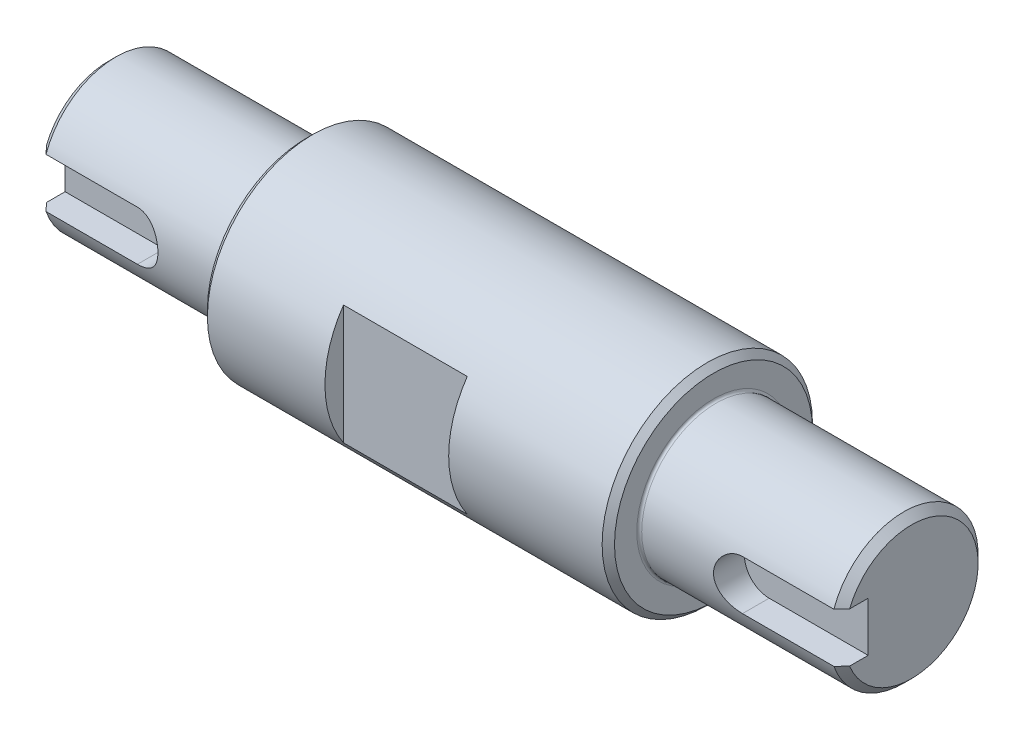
ISO-10303-21;
HEADER;
FILE_DESCRIPTION(('STEP AP214'),'2;1');
FILE_NAME('part.step','',(''),(''),'','','');
FILE_SCHEMA(('AUTOMOTIVE_DESIGN { 1 0 10303 214 1 1 1 1 }'));
ENDSEC;
DATA;
#1=APPLICATION_CONTEXT('core data for automotive mechanical design processes');
#2=APPLICATION_PROTOCOL_DEFINITION('international standard','automotive_design',2000,#1);
#3=PRODUCT_CONTEXT('',#1,'mechanical');
#4=PRODUCT('Part','Part','',(#3));
#5=PRODUCT_RELATED_PRODUCT_CATEGORY('part','',(#4));
#6=PRODUCT_DEFINITION_FORMATION('','',#4);
#7=PRODUCT_DEFINITION_CONTEXT('part definition',#1,'design');
#8=PRODUCT_DEFINITION('design','',#6,#7);
#9=PRODUCT_DEFINITION_SHAPE('','',#8);
#10=(LENGTH_UNIT() NAMED_UNIT(*) SI_UNIT(.MILLI.,.METRE.));
#11=(NAMED_UNIT(*) PLANE_ANGLE_UNIT() SI_UNIT($,.RADIAN.));
#12=(NAMED_UNIT(*) SI_UNIT($,.STERADIAN.) SOLID_ANGLE_UNIT());
#13=UNCERTAINTY_MEASURE_WITH_UNIT(LENGTH_MEASURE(1.E-05),#10,'distance_accuracy_value','');
#14=(GEOMETRIC_REPRESENTATION_CONTEXT(3) GLOBAL_UNCERTAINTY_ASSIGNED_CONTEXT((#13)) GLOBAL_UNIT_ASSIGNED_CONTEXT((#10,
#11,#12)) REPRESENTATION_CONTEXT('',''));
#15=CARTESIAN_POINT('',(0.,0.,0.));
#16=DIRECTION('',(0.,0.,1.));
#17=DIRECTION('',(1.,0.,0.));
#18=AXIS2_PLACEMENT_3D('',#15,#16,#17);
#19=CARTESIAN_POINT('',(48.9,5.38650000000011,0.));
#20=DIRECTION('',(-1.,0.,0.));
#21=DIRECTION('',(0.,0.,1.));
#22=AXIS2_PLACEMENT_3D('',#19,#20,#21);
#23=PLANE('',#22);
#24=CARTESIAN_POINT('',(48.9,0.,0.));
#25=DIRECTION('',(-1.,0.,0.));
#26=DIRECTION('',(0.,0.,1.));
#27=AXIS2_PLACEMENT_3D('',#24,#25,#26);
#28=CIRCLE('',#27,5.3865);
#29=CARTESIAN_POINT('',(48.9,1.99999999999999,5.00143801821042));
#30=VERTEX_POINT('',#29);
#31=CARTESIAN_POINT('',(48.9,-1.99999999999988,5.0014380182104));
#32=VERTEX_POINT('',#31);
#33=EDGE_CURVE('E346',#30,#32,#28,.T.);
#34=ORIENTED_EDGE('',*,*,#33,.F.);
#35=DIRECTION('',(0.,0.,-1.));
#36=VECTOR('',#35,1.);
#37=CARTESIAN_POINT('',(48.9,1.99999999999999,0.));
#38=LINE('',#37,#36);
#39=CARTESIAN_POINT('',(48.9,1.99999999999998,3.50000000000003));
#40=VERTEX_POINT('',#39);
#41=EDGE_CURVE('E347',#30,#40,#38,.T.);
#42=ORIENTED_EDGE('',*,*,#41,.T.);
#43=DIRECTION('',(0.,1.,0.));
#44=VECTOR('',#43,1.);
#45=CARTESIAN_POINT('',(48.9,5.38650000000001,3.50000000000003));
#46=LINE('',#45,#44);
#47=CARTESIAN_POINT('',(48.9,-2.00000000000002,3.50000000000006));
#48=VERTEX_POINT('',#47);
#49=EDGE_CURVE('E11',#48,#40,#46,.T.);
#50=ORIENTED_EDGE('',*,*,#49,.F.);
#51=DIRECTION('',(0.,0.,1.));
#52=VECTOR('',#51,1.);
#53=CARTESIAN_POINT('',(48.9,-1.99999999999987,0.));
#54=LINE('',#53,#52);
#55=EDGE_CURVE('E185',#48,#32,#54,.T.);
#56=ORIENTED_EDGE('',*,*,#55,.T.);
#57=EDGE_LOOP('',(#34,#42,#50,#56));
#58=FACE_BOUND('',#57,.T.);
#59=ADVANCED_FACE('F42',(#58),#23,.F.);
#60=CARTESIAN_POINT('',(48.9,0.,0.));
#61=DIRECTION('',(-1.,0.,0.));
#62=DIRECTION('',(0.,0.,1.));
#63=AXIS2_PLACEMENT_3D('',#60,#61,#62);
#64=CONICAL_SURFACE('',#63,5.3865,0.785398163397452);
#65=CARTESIAN_POINT('',(48.2865,0.,0.));
#66=DIRECTION('',(-1.,0.,0.));
#67=DIRECTION('',(0.,0.,1.));
#68=AXIS2_PLACEMENT_3D('',#65,#66,#67);
#69=CIRCLE('',#68,6.);
#70=CARTESIAN_POINT('',(48.2865,1.99999999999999,5.65685424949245));
#71=VERTEX_POINT('',#70);
#72=CARTESIAN_POINT('',(48.2865,-1.99999999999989,5.65685424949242));
#73=VERTEX_POINT('',#72);
#74=EDGE_CURVE('E351',#71,#73,#69,.T.);
#75=ORIENTED_EDGE('',*,*,#74,.F.);
#76=CARTESIAN_POINT('',(45.3624129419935,2.00000000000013,8.69708743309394));
#77=CARTESIAN_POINT('',(45.6454289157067,2.00000000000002,8.40663369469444));
#78=CARTESIAN_POINT('',(45.9281287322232,1.99999999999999,8.11586912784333));
#79=CARTESIAN_POINT('',(46.4924422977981,1.99999999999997,7.53344272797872));
#80=CARTESIAN_POINT('',(46.7740563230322,1.99999999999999,7.24178116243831));
#81=CARTESIAN_POINT('',(47.3355035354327,1.99999999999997,6.65753899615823));
#82=CARTESIAN_POINT('',(47.6153386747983,1.99999999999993,6.36496027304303));
#83=CARTESIAN_POINT('',(48.1730528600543,2.00000000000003,5.77778297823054));
#84=CARTESIAN_POINT('',(48.4509313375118,2.00000000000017,5.48318386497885));
#85=CARTESIAN_POINT('',(48.8656819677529,2.00000000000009,5.03865801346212));
#86=CARTESIAN_POINT('',(49.003759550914,2.00000000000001,4.88985656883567));
#87=CARTESIAN_POINT('',(49.2788530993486,1.99999999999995,4.59128639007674));
#88=CARTESIAN_POINT('',(49.4158691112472,1.99999999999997,4.44151769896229));
#89=CARTESIAN_POINT('',(49.6884149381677,1.99999999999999,4.14082357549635));
#90=CARTESIAN_POINT('',(49.8239457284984,1.99999999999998,3.98989902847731));
#91=CARTESIAN_POINT('',(50.0931447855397,1.99999999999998,3.68634803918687));
#92=CARTESIAN_POINT('',(50.2268127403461,1.99999999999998,3.53372131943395));
#93=CARTESIAN_POINT('',(50.4918168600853,1.99999999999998,3.22580044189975));
#94=CARTESIAN_POINT('',(50.623146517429,1.99999999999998,3.07050066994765));
#95=CARTESIAN_POINT('',(50.8818540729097,1.99999999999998,2.7567298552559));
#96=CARTESIAN_POINT('',(51.0092337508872,1.99999999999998,2.59826029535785));
#97=CARTESIAN_POINT('',(51.1958819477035,1.99999999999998,2.35679881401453));
#98=CARTESIAN_POINT('',(51.2574377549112,1.99999999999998,2.27557812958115));
#99=CARTESIAN_POINT('',(51.378556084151,1.99999999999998,2.11168094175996));
#100=CARTESIAN_POINT('',(51.4381189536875,1.99999999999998,2.02900469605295));
#101=CARTESIAN_POINT('',(51.5547650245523,1.99999999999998,1.86171436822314));
#102=CARTESIAN_POINT('',(51.6118442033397,1.99999999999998,1.77709745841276));
#103=CARTESIAN_POINT('',(51.6948961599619,1.99999999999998,1.64847799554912));
#104=CARTESIAN_POINT('',(51.7221602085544,1.99999999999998,1.60530916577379));
#105=CARTESIAN_POINT('',(51.7756831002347,1.99999999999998,1.51834501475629));
#106=CARTESIAN_POINT('',(51.8019417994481,1.99999999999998,1.47454960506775));
#107=CARTESIAN_POINT('',(51.8276224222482,1.99999999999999,1.4304121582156));
#108=B_SPLINE_CURVE_WITH_KNOTS('',3,(#76,#77,#78,#79,#80,#81,#82,#83,#84,#85,#86,#87,#88,#89,
#90,#91,#92,#93,#94,#95,#96,#97,#98,#99,#100,#101,#102,#103,#104,#105,#106,#107),.UNSPECIFIED.,
.F.,.F.,(4,2,2,2,2,2,2,2,2,2,2,2,2,2,2,4),(0.,1.21661814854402,2.43290318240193,
3.64747190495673,4.86238000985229,5.47136368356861,6.0803204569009,6.68884996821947,
7.29748017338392,7.90759996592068,8.51744072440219,8.82315177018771,9.1288092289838,
9.43494458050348,9.58810502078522,9.74128729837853),.UNSPECIFIED.);
#109=EDGE_CURVE('E421',#71,#30,#108,.T.);
#110=ORIENTED_EDGE('',*,*,#109,.T.);
#111=ORIENTED_EDGE('',*,*,#33,.T.);
#112=CARTESIAN_POINT('',(51.8276224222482,-1.99999999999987,1.4304121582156));
#113=CARTESIAN_POINT('',(51.797032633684,-1.99999999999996,1.48298112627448));
#114=CARTESIAN_POINT('',(51.7656276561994,-2.,1.5350653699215));
#115=CARTESIAN_POINT('',(51.7014324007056,-2.00000000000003,1.63835907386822));
#116=CARTESIAN_POINT('',(51.6686424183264,-2.00000000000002,1.68956871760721));
#117=CARTESIAN_POINT('',(51.5685962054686,-2.00000000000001,1.84197877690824));
#118=CARTESIAN_POINT('',(51.4996135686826,-2.00000000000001,1.94204482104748));
#119=CARTESIAN_POINT('',(51.3584892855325,-2.00000000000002,2.13962756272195));
#120=CARTESIAN_POINT('',(51.2863535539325,-2.00000000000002,2.23714852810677));
#121=CARTESIAN_POINT('',(51.1396400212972,-2.00000000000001,2.430365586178));
#122=CARTESIAN_POINT('',(51.0650616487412,-2.00000000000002,2.52606124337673));
#123=CARTESIAN_POINT('',(50.9142685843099,-2.00000000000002,2.71574007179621));
#124=CARTESIAN_POINT('',(50.8380586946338,-2.00000000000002,2.80972707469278));
#125=CARTESIAN_POINT('',(50.6842286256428,-2.00000000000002,2.99652380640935));
#126=CARTESIAN_POINT('',(50.6066085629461,-2.00000000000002,3.08933363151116));
#127=CARTESIAN_POINT('',(50.3720099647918,-2.00000000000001,3.36644822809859));
#128=CARTESIAN_POINT('',(50.2133685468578,-2.,3.54934443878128));
#129=CARTESIAN_POINT('',(49.9447951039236,-2.,3.85405281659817));
#130=CARTESIAN_POINT('',(49.8356409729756,-2.00000000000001,3.97655605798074));
#131=CARTESIAN_POINT('',(49.6163111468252,-2.00000000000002,4.22060896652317));
#132=CARTESIAN_POINT('',(49.506135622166,-2.00000000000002,4.34215878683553));
#133=CARTESIAN_POINT('',(49.2848771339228,-2.00000000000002,4.58461411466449));
#134=CARTESIAN_POINT('',(49.1737934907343,-2.00000000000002,4.70551900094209));
#135=CARTESIAN_POINT('',(48.9509614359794,-2.00000000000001,4.94672556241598));
#136=CARTESIAN_POINT('',(48.839212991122,-2.,5.0670272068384));
#137=CARTESIAN_POINT('',(48.4504796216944,-1.99999999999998,5.48366803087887));
#138=CARTESIAN_POINT('',(48.1721440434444,-2.00000000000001,5.77874667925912));
#139=CARTESIAN_POINT('',(47.6134336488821,-2.00000000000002,6.36695911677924));
#140=CARTESIAN_POINT('',(47.3330588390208,-2.00000000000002,6.66009291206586));
#141=CARTESIAN_POINT('',(46.7715213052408,-2.00000000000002,7.24440898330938));
#142=CARTESIAN_POINT('',(46.4903615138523,-2.00000000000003,7.53559407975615));
#143=CARTESIAN_POINT('',(45.927043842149,-2.00000000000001,8.11698520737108));
#144=CARTESIAN_POINT('',(45.6448859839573,-1.99999999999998,8.40719125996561));
#145=CARTESIAN_POINT('',(45.3624129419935,-1.9999999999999,8.69708743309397));
#146=B_SPLINE_CURVE_WITH_KNOTS('',3,(#112,#113,#114,#115,#116,#117,#118,#119,#120,#121,#122,
#123,#124,#125,#126,#127,#128,#129,#130,#131,#132,#133,#134,#135,#136,#137,#138,#139,#140,#141,
#142,#143,#144,#145),.UNSPECIFIED.,.F.,.F.,(4,2,2,2,2,2,2,2,2,2,2,2,2,2,2,2,4),(0.,
0.182442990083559,0.364847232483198,0.729361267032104,1.09321863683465,1.45716175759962,
1.82015078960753,2.18310993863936,2.90938913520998,3.4016198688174,3.89376984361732,
4.38632988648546,4.87891480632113,6.09580990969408,7.31270116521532,8.52701135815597,
9.74129480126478),.UNSPECIFIED.);
#147=EDGE_CURVE('E199',#32,#73,#146,.T.);
#148=ORIENTED_EDGE('',*,*,#147,.T.);
#149=EDGE_LOOP('',(#75,#110,#111,#148));
#150=FACE_BOUND('',#149,.T.);
#151=ADVANCED_FACE('F209',(#150),#64,.T.);
#152=CARTESIAN_POINT('',(48.9,0.,0.));
#153=DIRECTION('',(-1.,0.,0.));
#154=DIRECTION('',(0.,0.,1.));
#155=AXIS2_PLACEMENT_3D('',#152,#153,#154);
#156=CYLINDRICAL_SURFACE('',#155,6.);
#157=CARTESIAN_POINT('',(33.1,0.,0.));
#158=DIRECTION('',(-1.,0.,0.));
#159=DIRECTION('',(0.,0.,1.));
#160=AXIS2_PLACEMENT_3D('',#157,#158,#159);
#161=CIRCLE('',#160,6.);
#162=CARTESIAN_POINT('',(33.1,0.,6.00000000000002));
#163=VERTEX_POINT('',#162);
#164=EDGE_CURVE('E360',#163,#163,#161,.T.);
#165=ORIENTED_EDGE('',*,*,#164,.F.);
#166=EDGE_LOOP('',(#165));
#167=FACE_BOUND('',#166,.T.);
#168=DIRECTION('',(-1.,0.,0.));
#169=VECTOR('',#168,1.);
#170=CARTESIAN_POINT('',(48.9,-1.99999999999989,5.65685424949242));
#171=LINE('',#170,#169);
#172=CARTESIAN_POINT('',(40.9,-1.99999999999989,5.65685424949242));
#173=VERTEX_POINT('',#172);
#174=EDGE_CURVE('E50',#73,#173,#171,.T.);
#175=ORIENTED_EDGE('',*,*,#174,.T.);
#176=CARTESIAN_POINT('',(40.9,-1.99999999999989,5.65685424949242));
#177=CARTESIAN_POINT('',(40.8454190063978,-2.00000149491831,5.65684884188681));
#178=CARTESIAN_POINT('',(40.7908658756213,-1.9977642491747,5.65764519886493));
#179=CARTESIAN_POINT('',(40.6821828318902,-1.98885121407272,5.66078654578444));
#180=CARTESIAN_POINT('',(40.6280528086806,-1.98217662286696,5.66313111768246));
#181=CARTESIAN_POINT('',(40.4672157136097,-1.95562135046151,5.67238184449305));
#182=CARTESIAN_POINT('',(40.361638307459,-1.92920846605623,5.68150584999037));
#183=CARTESIAN_POINT('',(40.1567496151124,-1.85991682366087,5.70456149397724));
#184=CARTESIAN_POINT('',(40.0574349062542,-1.81704715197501,5.71849047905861));
#185=CARTESIAN_POINT('',(39.8673203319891,-1.71614645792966,5.74957574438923));
#186=CARTESIAN_POINT('',(39.7765257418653,-1.65810612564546,5.76673400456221));
#187=CARTESIAN_POINT('',(39.6025595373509,-1.52610278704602,5.803089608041));
#188=CARTESIAN_POINT('',(39.5197702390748,-1.45164996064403,5.82233755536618));
#189=CARTESIAN_POINT('',(39.3675879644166,-1.28997688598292,5.86027697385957));
#190=CARTESIAN_POINT('',(39.2981973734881,-1.20275436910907,5.87896834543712));
#191=CARTESIAN_POINT('',(39.1730409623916,-1.01520729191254,5.91427765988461));
#192=CARTESIAN_POINT('',(39.1176780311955,-0.914600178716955,5.93082875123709));
#193=CARTESIAN_POINT('',(39.0248154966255,-0.704858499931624,5.95939217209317));
#194=CARTESIAN_POINT('',(38.9873104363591,-0.595726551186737,5.97140588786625));
#195=CARTESIAN_POINT('',(38.9325285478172,-0.376058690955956,5.98918142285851));
#196=CARTESIAN_POINT('',(38.9145934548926,-0.265703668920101,5.99514617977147));
#197=CARTESIAN_POINT('',(38.8973674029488,-0.0433979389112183,6.00087216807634));
#198=CARTESIAN_POINT('',(38.8980720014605,0.0685523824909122,6.00063487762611));
#199=CARTESIAN_POINT('',(38.9176885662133,0.286207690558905,5.99412077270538));
#200=CARTESIAN_POINT('',(38.9358852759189,0.391985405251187,5.98808121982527));
#201=CARTESIAN_POINT('',(38.9887863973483,0.598888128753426,5.97093921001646));
#202=CARTESIAN_POINT('',(39.0234917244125,0.700012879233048,5.95983647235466));
#203=CARTESIAN_POINT('',(39.1088427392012,0.896305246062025,5.93351336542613));
#204=CARTESIAN_POINT('',(39.1596920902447,0.99137701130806,5.91824075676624));
#205=CARTESIAN_POINT('',(39.2757199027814,1.171849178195,5.88516775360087));
#206=CARTESIAN_POINT('',(39.340902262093,1.25724693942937,5.86736667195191));
#207=CARTESIAN_POINT('',(39.4873420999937,1.42019467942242,5.83012543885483));
#208=CARTESIAN_POINT('',(39.5692110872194,1.49718722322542,5.81064757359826));
#209=CARTESIAN_POINT('',(39.7448829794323,1.63654404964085,5.77294980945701));
#210=CARTESIAN_POINT('',(39.8386897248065,1.69890360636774,5.75473031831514));
#211=CARTESIAN_POINT('',(40.0373603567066,1.80800665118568,5.72140062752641));
#212=CARTESIAN_POINT('',(40.1423670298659,1.85450601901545,5.70634029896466));
#213=CARTESIAN_POINT('',(40.3592939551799,1.92892046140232,5.68162194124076));
#214=CARTESIAN_POINT('',(40.4712029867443,1.95686487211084,5.67195538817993));
#215=CARTESIAN_POINT('',(40.636837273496,1.98331631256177,5.66273084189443));
#216=CARTESIAN_POINT('',(40.6892827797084,1.98957012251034,5.66053335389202));
#217=CARTESIAN_POINT('',(40.7944761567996,1.99790923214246,5.65759407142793));
#218=CARTESIAN_POINT('',(40.8472235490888,1.99999991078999,5.65685039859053));
#219=CARTESIAN_POINT('',(40.9,1.99999999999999,5.65685424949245));
#220=B_SPLINE_CURVE_WITH_KNOTS('',3,(#176,#177,#178,#179,#180,#181,#182,#183,#184,#185,#186,
#187,#188,#189,#190,#191,#192,#193,#194,#195,#196,#197,#198,#199,#200,#201,#202,#203,#204,#205,
#206,#207,#208,#209,#210,#211,#212,#213,#214,#215,#216,#217,#218,#219),.UNSPECIFIED.,.F.,.F.,(4,
2,2,2,2,2,2,2,2,2,2,2,2,2,2,2,2,2,2,2,2,4),(0.,0.163636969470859,0.327229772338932,
0.653162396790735,0.978915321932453,1.3048686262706,1.64233009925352,1.9798515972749,
2.32618265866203,2.67240782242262,3.00658941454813,3.34069136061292,3.66168836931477,
3.98270317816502,4.30794037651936,4.63326613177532,4.973881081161,5.31460588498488,
5.66036059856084,6.00556734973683,6.16399790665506,6.32222363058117),.UNSPECIFIED.);
#221=CARTESIAN_POINT('',(40.9,1.99999999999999,5.65685424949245));
#222=VERTEX_POINT('',#221);
#223=EDGE_CURVE('E60',#173,#222,#220,.T.);
#224=ORIENTED_EDGE('',*,*,#223,.T.);
#225=DIRECTION('',(-1.,0.,0.));
#226=VECTOR('',#225,1.);
#227=CARTESIAN_POINT('',(48.9,1.99999999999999,5.65685424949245));
#228=LINE('',#227,#226);
#229=EDGE_CURVE('E231',#222,#71,#228,.F.);
#230=ORIENTED_EDGE('',*,*,#229,.T.);
#231=ORIENTED_EDGE('',*,*,#74,.T.);
#232=EDGE_LOOP('',(#175,#224,#230,#231));
#233=FACE_BOUND('',#232,.T.);
#234=ADVANCED_FACE('F239',(#167,#233),#156,.T.);
#235=CARTESIAN_POINT('',(33.1000000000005,0.,0.));
#236=DIRECTION('',(-1.,0.,0.));
#237=DIRECTION('',(0.,0.,1.));
#238=AXIS2_PLACEMENT_3D('',#235,#236,#237);
#239=TOROIDAL_SURFACE('',#238,6.20000000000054,0.200000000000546);
#240=CARTESIAN_POINT('',(32.9,0.,0.));
#241=DIRECTION('',(-1.,0.,0.));
#242=DIRECTION('',(0.,0.,1.));
#243=AXIS2_PLACEMENT_3D('',#240,#241,#242);
#244=CIRCLE('',#243,6.2);
#245=CARTESIAN_POINT('',(32.9,0.,6.20000000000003));
#246=VERTEX_POINT('',#245);
#247=EDGE_CURVE('E592',#246,#246,#244,.T.);
#248=ORIENTED_EDGE('',*,*,#247,.F.);
#249=EDGE_LOOP('',(#248));
#250=FACE_BOUND('',#249,.T.);
#251=ORIENTED_EDGE('',*,*,#164,.T.);
#252=EDGE_LOOP('',(#251));
#253=FACE_BOUND('',#252,.T.);
#254=ADVANCED_FACE('F243',(#250,#253),#239,.F.);
#255=CARTESIAN_POINT('',(32.9,8.00000000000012,0.));
#256=DIRECTION('',(-1.,0.,0.));
#257=DIRECTION('',(0.,0.,1.));
#258=AXIS2_PLACEMENT_3D('',#255,#256,#257);
#259=PLANE('',#258);
#260=CARTESIAN_POINT('',(32.9,0.,0.));
#261=DIRECTION('',(-1.,0.,0.));
#262=DIRECTION('',(0.,0.,1.));
#263=AXIS2_PLACEMENT_3D('',#260,#261,#262);
#264=CIRCLE('',#263,8.);
#265=CARTESIAN_POINT('',(32.9,0.,8.00000000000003));
#266=VERTEX_POINT('',#265);
#267=EDGE_CURVE('E588',#266,#266,#264,.T.);
#268=ORIENTED_EDGE('',*,*,#267,.F.);
#269=EDGE_LOOP('',(#268));
#270=FACE_BOUND('',#269,.T.);
#271=ORIENTED_EDGE('',*,*,#247,.T.);
#272=EDGE_LOOP('',(#271));
#273=FACE_BOUND('',#272,.T.);
#274=ADVANCED_FACE('F247',(#270,#273),#259,.F.);
#275=CARTESIAN_POINT('',(32.9,0.,0.));
#276=DIRECTION('',(-1.,0.,0.));
#277=DIRECTION('',(0.,0.,1.));
#278=AXIS2_PLACEMENT_3D('',#275,#276,#277);
#279=CONICAL_SURFACE('',#278,8.,0.785398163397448);
#280=CARTESIAN_POINT('',(32.4,0.,0.));
#281=DIRECTION('',(-1.,0.,0.));
#282=DIRECTION('',(0.,0.,1.));
#283=AXIS2_PLACEMENT_3D('',#280,#281,#282);
#284=CIRCLE('',#283,8.5);
#285=CARTESIAN_POINT('',(32.4,0.,8.50000000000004));
#286=VERTEX_POINT('',#285);
#287=EDGE_CURVE('E584',#286,#286,#284,.T.);
#288=ORIENTED_EDGE('',*,*,#287,.F.);
#289=EDGE_LOOP('',(#288));
#290=FACE_BOUND('',#289,.T.);
#291=ORIENTED_EDGE('',*,*,#267,.T.);
#292=EDGE_LOOP('',(#291));
#293=FACE_BOUND('',#292,.T.);
#294=ADVANCED_FACE('F251',(#290,#293),#279,.T.);
#295=CARTESIAN_POINT('',(48.9,0.,0.));
#296=DIRECTION('',(-1.,0.,0.));
#297=DIRECTION('',(0.,0.,1.));
#298=AXIS2_PLACEMENT_3D('',#295,#296,#297);
#299=CYLINDRICAL_SURFACE('',#298,8.5);
#300=DIRECTION('',(-1.,0.,0.));
#301=VECTOR('',#300,1.);
#302=CARTESIAN_POINT('',(48.9,4.82182538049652,7.00000000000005));
#303=LINE('',#302,#301);
#304=CARTESIAN_POINT('',(20.,4.82182538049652,7.00000000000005));
#305=VERTEX_POINT('',#304);
#306=CARTESIAN_POINT('',(10.,4.82182538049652,7.00000000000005));
#307=VERTEX_POINT('',#306);
#308=EDGE_CURVE('E377',#305,#307,#303,.T.);
#309=ORIENTED_EDGE('',*,*,#308,.F.);
#310=CARTESIAN_POINT('',(20.,0.,0.));
#311=DIRECTION('',(1.,0.,0.));
#312=DIRECTION('',(0.,0.,-1.));
#313=AXIS2_PLACEMENT_3D('',#310,#311,#312);
#314=CIRCLE('',#313,8.5);
#315=CARTESIAN_POINT('',(20.,-4.82182538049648,7.00000000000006));
#316=VERTEX_POINT('',#315);
#317=EDGE_CURVE('E373',#305,#316,#314,.T.);
#318=ORIENTED_EDGE('',*,*,#317,.T.);
#319=DIRECTION('',(-1.,0.,0.));
#320=VECTOR('',#319,1.);
#321=CARTESIAN_POINT('',(48.9,-4.82182538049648,7.00000000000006));
#322=LINE('',#321,#320);
#323=CARTESIAN_POINT('',(10.,-4.82182538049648,7.00000000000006));
#324=VERTEX_POINT('',#323);
#325=EDGE_CURVE('E374',#324,#316,#322,.F.);
#326=ORIENTED_EDGE('',*,*,#325,.F.);
#327=CARTESIAN_POINT('',(10.,0.,0.));
#328=DIRECTION('',(1.,0.,0.));
#329=DIRECTION('',(0.,0.,-1.));
#330=AXIS2_PLACEMENT_3D('',#327,#328,#329);
#331=CIRCLE('',#330,8.5);
#332=EDGE_CURVE('E358',#307,#324,#331,.T.);
#333=ORIENTED_EDGE('',*,*,#332,.F.);
#334=EDGE_LOOP('',(#309,#318,#326,#333));
#335=FACE_BOUND('',#334,.T.);
#336=DIRECTION('',(-1.,0.,0.));
#337=VECTOR('',#336,1.);
#338=CARTESIAN_POINT('',(48.9,-4.82182538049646,-6.99999999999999));
#339=LINE('',#338,#337);
#340=CARTESIAN_POINT('',(20.,-4.82182538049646,-6.99999999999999));
#341=VERTEX_POINT('',#340);
#342=CARTESIAN_POINT('',(10.,-4.82182538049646,-6.99999999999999));
#343=VERTEX_POINT('',#342);
#344=EDGE_CURVE('E366',#341,#343,#339,.T.);
#345=ORIENTED_EDGE('',*,*,#344,.F.);
#346=CARTESIAN_POINT('',(20.,4.82182538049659,-7.00000000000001));
#347=VERTEX_POINT('',#346);
#348=EDGE_CURVE('E369',#341,#347,#314,.T.);
#349=ORIENTED_EDGE('',*,*,#348,.T.);
#350=DIRECTION('',(-1.,0.,0.));
#351=VECTOR('',#350,1.);
#352=CARTESIAN_POINT('',(48.9,4.82182538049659,-7.00000000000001));
#353=LINE('',#352,#351);
#354=CARTESIAN_POINT('',(10.,4.82182538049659,-7.00000000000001));
#355=VERTEX_POINT('',#354);
#356=EDGE_CURVE('E356',#355,#347,#353,.F.);
#357=ORIENTED_EDGE('',*,*,#356,.F.);
#358=EDGE_CURVE('E350',#343,#355,#331,.T.);
#359=ORIENTED_EDGE('',*,*,#358,.F.);
#360=EDGE_LOOP('',(#345,#349,#357,#359));
#361=FACE_BOUND('',#360,.T.);
#362=CARTESIAN_POINT('',(0.5,0.,0.));
#363=DIRECTION('',(-1.,0.,0.));
#364=DIRECTION('',(0.,0.,1.));
#365=AXIS2_PLACEMENT_3D('',#362,#363,#364);
#366=CIRCLE('',#365,8.5);
#367=CARTESIAN_POINT('',(0.5,0.,8.50000000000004));
#368=VERTEX_POINT('',#367);
#369=EDGE_CURVE('E580',#368,#368,#366,.T.);
#370=ORIENTED_EDGE('',*,*,#369,.F.);
#371=EDGE_LOOP('',(#370));
#372=FACE_BOUND('',#371,.T.);
#373=ORIENTED_EDGE('',*,*,#287,.T.);
#374=EDGE_LOOP('',(#373));
#375=FACE_BOUND('',#374,.T.);
#376=ADVANCED_FACE('F255',(#335,#361,#372,#375),#299,.T.);
#377=CARTESIAN_POINT('',(0.5,0.,0.));
#378=DIRECTION('',(1.,0.,0.));
#379=DIRECTION('',(0.,0.,-1.));
#380=AXIS2_PLACEMENT_3D('',#377,#378,#379);
#381=CONICAL_SURFACE('',#380,8.5,0.785398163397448);
#382=CARTESIAN_POINT('',(0.,0.,0.));
#383=DIRECTION('',(-1.,0.,0.));
#384=DIRECTION('',(0.,0.,1.));
#385=AXIS2_PLACEMENT_3D('',#382,#383,#384);
#386=CIRCLE('',#385,8.);
#387=CARTESIAN_POINT('',(0.,0.,8.00000000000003));
#388=VERTEX_POINT('',#387);
#389=EDGE_CURVE('E576',#388,#388,#386,.T.);
#390=ORIENTED_EDGE('',*,*,#389,.F.);
#391=EDGE_LOOP('',(#390));
#392=FACE_BOUND('',#391,.T.);
#393=ORIENTED_EDGE('',*,*,#369,.T.);
#394=EDGE_LOOP('',(#393));
#395=FACE_BOUND('',#394,.T.);
#396=ADVANCED_FACE('F259',(#392,#395),#381,.T.);
#397=CARTESIAN_POINT('',(0.,6.20000000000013,0.));
#398=DIRECTION('',(1.,0.,0.));
#399=DIRECTION('',(0.,0.,-1.));
#400=AXIS2_PLACEMENT_3D('',#397,#398,#399);
#401=PLANE('',#400);
#402=CARTESIAN_POINT('',(0.,0.,0.));
#403=DIRECTION('',(-1.,0.,0.));
#404=DIRECTION('',(0.,0.,1.));
#405=AXIS2_PLACEMENT_3D('',#402,#403,#404);
#406=CIRCLE('',#405,6.2);
#407=CARTESIAN_POINT('',(0.,0.,6.20000000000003));
#408=VERTEX_POINT('',#407);
#409=EDGE_CURVE('E572',#408,#408,#406,.T.);
#410=ORIENTED_EDGE('',*,*,#409,.F.);
#411=EDGE_LOOP('',(#410));
#412=FACE_BOUND('',#411,.T.);
#413=ORIENTED_EDGE('',*,*,#389,.T.);
#414=EDGE_LOOP('',(#413));
#415=FACE_BOUND('',#414,.T.);
#416=ADVANCED_FACE('F263',(#412,#415),#401,.F.);
#417=CARTESIAN_POINT('',(-0.20000000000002,0.,0.));
#418=DIRECTION('',(-1.,0.,0.));
#419=DIRECTION('',(0.,0.,1.));
#420=AXIS2_PLACEMENT_3D('',#417,#418,#419);
#421=TOROIDAL_SURFACE('',#420,6.20000000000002,0.200000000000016);
#422=CARTESIAN_POINT('',(-0.199999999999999,0.,0.));
#423=DIRECTION('',(-1.,0.,0.));
#424=DIRECTION('',(0.,0.,1.));
#425=AXIS2_PLACEMENT_3D('',#422,#423,#424);
#426=CIRCLE('',#425,6.);
#427=CARTESIAN_POINT('',(-0.199999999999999,0.,6.00000000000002));
#428=VERTEX_POINT('',#427);
#429=EDGE_CURVE('E559',#428,#428,#426,.T.);
#430=ORIENTED_EDGE('',*,*,#429,.F.);
#431=EDGE_LOOP('',(#430));
#432=FACE_BOUND('',#431,.T.);
#433=ORIENTED_EDGE('',*,*,#409,.T.);
#434=EDGE_LOOP('',(#433));
#435=FACE_BOUND('',#434,.T.);
#436=ADVANCED_FACE('F267',(#432,#435),#421,.F.);
#437=CARTESIAN_POINT('',(48.9,0.,0.));
#438=DIRECTION('',(-1.,0.,0.));
#439=DIRECTION('',(0.,0.,1.));
#440=AXIS2_PLACEMENT_3D('',#437,#438,#439);
#441=CYLINDRICAL_SURFACE('',#440,6.);
#442=CARTESIAN_POINT('',(-15.3865,0.,0.));
#443=DIRECTION('',(-1.,0.,0.));
#444=DIRECTION('',(0.,0.,1.));
#445=AXIS2_PLACEMENT_3D('',#442,#443,#444);
#446=CIRCLE('',#445,6.);
#447=CARTESIAN_POINT('',(-15.3865,1.99999999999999,5.65685424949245));
#448=VERTEX_POINT('',#447);
#449=CARTESIAN_POINT('',(-15.3865,-1.99999999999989,5.65685424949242));
#450=VERTEX_POINT('',#449);
#451=EDGE_CURVE('E554',#448,#450,#446,.T.);
#452=ORIENTED_EDGE('',*,*,#451,.F.);
#453=DIRECTION('',(-1.,0.,0.));
#454=VECTOR('',#453,1.);
#455=CARTESIAN_POINT('',(48.9,1.99999999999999,5.65685424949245));
#456=LINE('',#455,#454);
#457=CARTESIAN_POINT('',(-8.,1.99999999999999,5.65685424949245));
#458=VERTEX_POINT('',#457);
#459=EDGE_CURVE('E300',#448,#458,#456,.F.);
#460=ORIENTED_EDGE('',*,*,#459,.T.);
#461=CARTESIAN_POINT('',(-8.,1.99999999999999,5.65685424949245));
#462=CARTESIAN_POINT('',(-7.94541900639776,2.00000149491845,5.65684884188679));
#463=CARTESIAN_POINT('',(-7.89086587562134,1.99776424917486,5.65764519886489));
#464=CARTESIAN_POINT('',(-7.7821828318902,1.98885121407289,5.66078654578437));
#465=CARTESIAN_POINT('',(-7.72805280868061,1.98217662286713,5.6631311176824));
#466=CARTESIAN_POINT('',(-7.56721571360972,1.95562135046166,5.67238184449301));
#467=CARTESIAN_POINT('',(-7.46163830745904,1.92920846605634,5.68150584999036));
#468=CARTESIAN_POINT('',(-7.25674961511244,1.85991682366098,5.70456149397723));
#469=CARTESIAN_POINT('',(-7.15743490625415,1.81704715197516,5.71849047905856));
#470=CARTESIAN_POINT('',(-6.96732033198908,1.71614645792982,5.74957574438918));
#471=CARTESIAN_POINT('',(-6.87652574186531,1.65810612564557,5.76673400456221));
#472=CARTESIAN_POINT('',(-6.70255953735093,1.52610278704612,5.803089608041));
#473=CARTESIAN_POINT('',(-6.61977023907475,1.45164996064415,5.82233755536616));
#474=CARTESIAN_POINT('',(-6.46758796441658,1.289976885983,5.86027697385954));
#475=CARTESIAN_POINT('',(-6.39819737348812,1.20275436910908,5.87896834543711));
#476=CARTESIAN_POINT('',(-6.27304096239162,1.01520729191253,5.91427765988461));
#477=CARTESIAN_POINT('',(-6.21767803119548,0.91460017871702,5.93082875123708));
#478=CARTESIAN_POINT('',(-6.12481549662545,0.704858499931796,5.95939217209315));
#479=CARTESIAN_POINT('',(-6.08731043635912,0.595726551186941,5.97140588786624));
#480=CARTESIAN_POINT('',(-6.03252854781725,0.376058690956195,5.9891814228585));
#481=CARTESIAN_POINT('',(-6.01459345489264,0.265703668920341,5.99514617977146));
#482=CARTESIAN_POINT('',(-5.99736740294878,0.0433979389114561,6.00087216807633));
#483=CARTESIAN_POINT('',(-5.9980720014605,-0.068552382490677,6.00063487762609));
#484=CARTESIAN_POINT('',(-6.0176885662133,-0.286207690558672,5.99412077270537));
#485=CARTESIAN_POINT('',(-6.03588527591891,-0.391985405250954,5.98808121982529));
#486=CARTESIAN_POINT('',(-6.08878639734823,-0.598888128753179,5.97093921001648));
#487=CARTESIAN_POINT('',(-6.12349172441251,-0.700012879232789,5.95983647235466));
#488=CARTESIAN_POINT('',(-6.20884273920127,-0.896305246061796,5.93351336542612));
#489=CARTESIAN_POINT('',(-6.25969209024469,-0.991377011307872,5.91824075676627));
#490=CARTESIAN_POINT('',(-6.37571990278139,-1.17184917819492,5.88516775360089));
#491=CARTESIAN_POINT('',(-6.44090226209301,-1.25724693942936,5.8673666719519));
#492=CARTESIAN_POINT('',(-6.58734209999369,-1.42019467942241,5.83012543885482));
#493=CARTESIAN_POINT('',(-6.66921108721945,-1.49718722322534,5.81064757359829));
#494=CARTESIAN_POINT('',(-6.84488297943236,-1.63654404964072,5.77294980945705));
#495=CARTESIAN_POINT('',(-6.93868972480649,-1.69890360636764,5.75473031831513));
#496=CARTESIAN_POINT('',(-7.13736035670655,-1.80800665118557,5.72140062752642));
#497=CARTESIAN_POINT('',(-7.24236702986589,-1.85450601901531,5.70634029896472));
#498=CARTESIAN_POINT('',(-7.45929395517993,-1.92892046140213,5.68162194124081));
#499=CARTESIAN_POINT('',(-7.57120298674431,-1.95686487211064,5.67195538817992));
#500=CARTESIAN_POINT('',(-7.73683727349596,-1.98331631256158,5.66273084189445));
#501=CARTESIAN_POINT('',(-7.78928277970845,-1.98957012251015,5.66053335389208));
#502=CARTESIAN_POINT('',(-7.89447615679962,-1.9979092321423,5.657594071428));
#503=CARTESIAN_POINT('',(-7.94722354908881,-1.99999991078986,5.65685039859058));
#504=CARTESIAN_POINT('',(-8.,-1.99999999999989,5.65685424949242));
#505=B_SPLINE_CURVE_WITH_KNOTS('',3,(#461,#462,#463,#464,#465,#466,#467,#468,#469,#470,#471,
#472,#473,#474,#475,#476,#477,#478,#479,#480,#481,#482,#483,#484,#485,#486,#487,#488,#489,#490,
#491,#492,#493,#494,#495,#496,#497,#498,#499,#500,#501,#502,#503,#504),.UNSPECIFIED.,.F.,.F.,(4,
2,2,2,2,2,2,2,2,2,2,2,2,2,2,2,2,2,2,2,2,4),(0.,0.163636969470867,0.327229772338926,
0.653162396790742,0.97891532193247,1.30486862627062,1.64233009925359,1.97985159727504,
2.32618265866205,2.67240782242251,3.00658941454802,3.34069136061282,3.66168836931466,
3.98270317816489,4.30794037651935,4.63326613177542,4.97388108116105,5.31460588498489,
5.66036059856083,6.0055673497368,6.16399790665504,6.32222363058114),.UNSPECIFIED.);
#506=CARTESIAN_POINT('',(-8.,-1.99999999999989,5.65685424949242));
#507=VERTEX_POINT('',#506);
#508=EDGE_CURVE('E232',#458,#507,#505,.T.);
#509=ORIENTED_EDGE('',*,*,#508,.T.);
#510=DIRECTION('',(-1.,0.,0.));
#511=VECTOR('',#510,1.);
#512=CARTESIAN_POINT('',(48.9,-1.99999999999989,5.65685424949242));
#513=LINE('',#512,#511);
#514=EDGE_CURVE('E301',#507,#450,#513,.T.);
#515=ORIENTED_EDGE('',*,*,#514,.T.);
#516=EDGE_LOOP('',(#452,#460,#509,#515));
#517=FACE_BOUND('',#516,.T.);
#518=ORIENTED_EDGE('',*,*,#429,.T.);
#519=EDGE_LOOP('',(#518));
#520=FACE_BOUND('',#519,.T.);
#521=ADVANCED_FACE('F270',(#517,#520),#441,.T.);
#522=CARTESIAN_POINT('',(-15.3865,0.,0.));
#523=DIRECTION('',(1.,0.,0.));
#524=DIRECTION('',(0.,0.,-1.));
#525=AXIS2_PLACEMENT_3D('',#522,#523,#524);
#526=CONICAL_SURFACE('',#525,6.,0.785398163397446);
#527=CARTESIAN_POINT('',(-16.,0.,0.));
#528=DIRECTION('',(-1.,0.,0.));
#529=DIRECTION('',(0.,0.,1.));
#530=AXIS2_PLACEMENT_3D('',#527,#528,#529);
#531=CIRCLE('',#530,5.3865);
#532=CARTESIAN_POINT('',(-16.,1.99999999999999,5.00143801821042));
#533=VERTEX_POINT('',#532);
#534=CARTESIAN_POINT('',(-16.,-1.99999999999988,5.0014380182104));
#535=VERTEX_POINT('',#534);
#536=EDGE_CURVE('E553',#533,#535,#531,.T.);
#537=ORIENTED_EDGE('',*,*,#536,.F.);
#538=CARTESIAN_POINT('',(-18.9276224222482,1.99999999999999,1.43041215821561));
#539=CARTESIAN_POINT('',(-18.897032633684,1.99999999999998,1.4829811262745));
#540=CARTESIAN_POINT('',(-18.8656276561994,1.99999999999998,1.53506536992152));
#541=CARTESIAN_POINT('',(-18.8014324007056,1.99999999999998,1.63835907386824));
#542=CARTESIAN_POINT('',(-18.7686424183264,1.99999999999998,1.68956871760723));
#543=CARTESIAN_POINT('',(-18.6685962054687,1.99999999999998,1.84197877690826));
#544=CARTESIAN_POINT('',(-18.5996135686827,1.99999999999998,1.9420448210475));
#545=CARTESIAN_POINT('',(-18.4584892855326,1.99999999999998,2.13962756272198));
#546=CARTESIAN_POINT('',(-18.3863535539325,1.99999999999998,2.2371485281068));
#547=CARTESIAN_POINT('',(-18.2396400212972,1.99999999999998,2.43036558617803));
#548=CARTESIAN_POINT('',(-18.1650616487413,1.99999999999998,2.52606124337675));
#549=CARTESIAN_POINT('',(-18.0142685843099,1.99999999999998,2.71574007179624));
#550=CARTESIAN_POINT('',(-17.9380586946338,1.99999999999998,2.8097270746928));
#551=CARTESIAN_POINT('',(-17.7842286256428,1.99999999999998,2.99652380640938));
#552=CARTESIAN_POINT('',(-17.7066085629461,1.99999999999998,3.08933363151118));
#553=CARTESIAN_POINT('',(-17.4720099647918,1.99999999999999,3.36644822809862));
#554=CARTESIAN_POINT('',(-17.3133685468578,2.00000000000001,3.54934443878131));
#555=CARTESIAN_POINT('',(-17.0447951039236,2.,3.85405281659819));
#556=CARTESIAN_POINT('',(-16.9356409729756,1.99999999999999,3.97655605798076));
#557=CARTESIAN_POINT('',(-16.7163111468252,1.99999999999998,4.2206089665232));
#558=CARTESIAN_POINT('',(-16.606135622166,1.99999999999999,4.34215878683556));
#559=CARTESIAN_POINT('',(-16.3848771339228,1.99999999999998,4.58461411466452));
#560=CARTESIAN_POINT('',(-16.2737934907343,1.99999999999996,4.70551900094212));
#561=CARTESIAN_POINT('',(-16.0509614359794,2.,4.94672556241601));
#562=CARTESIAN_POINT('',(-15.939212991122,2.00000000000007,5.06702720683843));
#563=CARTESIAN_POINT('',(-15.5504796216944,2.00000000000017,5.48366803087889));
#564=CARTESIAN_POINT('',(-15.2721440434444,2.00000000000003,5.77874667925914));
#565=CARTESIAN_POINT('',(-14.7134336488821,1.99999999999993,6.36695911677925));
#566=CARTESIAN_POINT('',(-14.4330588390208,1.99999999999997,6.66009291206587));
#567=CARTESIAN_POINT('',(-13.8715213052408,1.99999999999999,7.24440898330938));
#568=CARTESIAN_POINT('',(-13.5903615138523,1.99999999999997,7.53559407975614));
#569=CARTESIAN_POINT('',(-13.0270438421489,1.99999999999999,8.11698520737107));
#570=CARTESIAN_POINT('',(-12.7448859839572,2.00000000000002,8.40719125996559));
#571=CARTESIAN_POINT('',(-12.4624129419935,2.00000000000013,8.69708743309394));
#572=B_SPLINE_CURVE_WITH_KNOTS('',3,(#538,#539,#540,#541,#542,#543,#544,#545,#546,#547,#548,
#549,#550,#551,#552,#553,#554,#555,#556,#557,#558,#559,#560,#561,#562,#563,#564,#565,#566,#567,
#568,#569,#570,#571),.UNSPECIFIED.,.F.,.F.,(4,2,2,2,2,2,2,2,2,2,2,2,2,2,2,2,4),(0.,
0.182442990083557,0.3648472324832,0.72936126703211,1.09321863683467,1.45716175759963,
1.82015078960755,2.18310993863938,2.90938913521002,3.40161986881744,3.89376984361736,
4.38632988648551,4.87891480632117,6.09580990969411,7.31270116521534,8.52701135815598,
9.74129480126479),.UNSPECIFIED.);
#573=EDGE_CURVE('E293',#533,#448,#572,.T.);
#574=ORIENTED_EDGE('',*,*,#573,.T.);
#575=ORIENTED_EDGE('',*,*,#451,.T.);
#576=CARTESIAN_POINT('',(-12.4624129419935,-1.9999999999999,8.69708743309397));
#577=CARTESIAN_POINT('',(-12.7454289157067,-1.99999999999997,8.40663369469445));
#578=CARTESIAN_POINT('',(-13.0281287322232,-2.,8.11586912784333));
#579=CARTESIAN_POINT('',(-13.5924422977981,-2.00000000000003,7.53344272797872));
#580=CARTESIAN_POINT('',(-13.8740563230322,-2.00000000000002,7.24178116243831));
#581=CARTESIAN_POINT('',(-14.4355035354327,-2.00000000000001,6.65753899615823));
#582=CARTESIAN_POINT('',(-14.7153386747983,-2.00000000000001,6.36496027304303));
#583=CARTESIAN_POINT('',(-15.2730528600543,-2.00000000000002,5.77778297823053));
#584=CARTESIAN_POINT('',(-15.5509313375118,-2.00000000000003,5.48318386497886));
#585=CARTESIAN_POINT('',(-15.9656819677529,-2.00000000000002,5.03865801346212));
#586=CARTESIAN_POINT('',(-16.103759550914,-2.00000000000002,4.88985656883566));
#587=CARTESIAN_POINT('',(-16.3788530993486,-2.00000000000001,4.59128639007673));
#588=CARTESIAN_POINT('',(-16.5158691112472,-2.00000000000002,4.44151769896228));
#589=CARTESIAN_POINT('',(-16.7884149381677,-2.00000000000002,4.14082357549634));
#590=CARTESIAN_POINT('',(-16.9239457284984,-2.00000000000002,3.98989902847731));
#591=CARTESIAN_POINT('',(-17.1931447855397,-2.00000000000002,3.68634803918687));
#592=CARTESIAN_POINT('',(-17.3268127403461,-2.00000000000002,3.53372131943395));
#593=CARTESIAN_POINT('',(-17.5918168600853,-2.00000000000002,3.22580044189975));
#594=CARTESIAN_POINT('',(-17.723146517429,-2.00000000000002,3.07050066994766));
#595=CARTESIAN_POINT('',(-17.9818540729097,-2.00000000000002,2.7567298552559));
#596=CARTESIAN_POINT('',(-18.1092337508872,-2.00000000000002,2.59826029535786));
#597=CARTESIAN_POINT('',(-18.2958819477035,-2.00000000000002,2.35679881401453));
#598=CARTESIAN_POINT('',(-18.3574377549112,-2.00000000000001,2.27557812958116));
#599=CARTESIAN_POINT('',(-18.478556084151,-2.00000000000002,2.11168094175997));
#600=CARTESIAN_POINT('',(-18.5381189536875,-2.00000000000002,2.02900469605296));
#601=CARTESIAN_POINT('',(-18.6547650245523,-2.00000000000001,1.86171436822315));
#602=CARTESIAN_POINT('',(-18.7118442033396,-2.00000000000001,1.77709745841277));
#603=CARTESIAN_POINT('',(-18.7948961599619,-2.00000000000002,1.64847799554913));
#604=CARTESIAN_POINT('',(-18.8221602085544,-2.00000000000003,1.6053091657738));
#605=CARTESIAN_POINT('',(-18.8756831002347,-2.,1.5183450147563));
#606=CARTESIAN_POINT('',(-18.9019417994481,-1.99999999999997,1.47454960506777));
#607=CARTESIAN_POINT('',(-18.9276224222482,-1.99999999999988,1.43041215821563));
#608=B_SPLINE_CURVE_WITH_KNOTS('',3,(#576,#577,#578,#579,#580,#581,#582,#583,#584,#585,#586,
#587,#588,#589,#590,#591,#592,#593,#594,#595,#596,#597,#598,#599,#600,#601,#602,#603,#604,#605,
#606,#607),.UNSPECIFIED.,.F.,.F.,(4,2,2,2,2,2,2,2,2,2,2,2,2,2,2,4),(0.,1.21661814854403,
2.43290318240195,3.64747190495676,4.86238000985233,5.47136368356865,6.08032045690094,
6.68884996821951,7.29748017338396,7.90759996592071,8.51744072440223,8.82315177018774,
9.12880922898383,9.4349445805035,9.58810502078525,9.74128729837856),.UNSPECIFIED.);
#609=EDGE_CURVE('E285',#450,#535,#608,.T.);
#610=ORIENTED_EDGE('',*,*,#609,.T.);
#611=EDGE_LOOP('',(#537,#574,#575,#610));
#612=FACE_BOUND('',#611,.T.);
#613=ADVANCED_FACE('F275',(#612),#526,.T.);
#614=CARTESIAN_POINT('',(-16.,0.,0.));
#615=DIRECTION('',(1.,0.,0.));
#616=DIRECTION('',(0.,0.,-1.));
#617=AXIS2_PLACEMENT_3D('',#614,#615,#616);
#618=PLANE('',#617);
#619=DIRECTION('',(0.,-1.,0.));
#620=VECTOR('',#619,1.);
#621=CARTESIAN_POINT('',(-16.,0.,3.50000000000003));
#622=LINE('',#621,#620);
#623=CARTESIAN_POINT('',(-16.,1.99999999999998,3.50000000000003));
#624=VERTEX_POINT('',#623);
#625=CARTESIAN_POINT('',(-16.,-2.00000000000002,3.50000000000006));
#626=VERTEX_POINT('',#625);
#627=EDGE_CURVE('E381',#624,#626,#622,.T.);
#628=ORIENTED_EDGE('',*,*,#627,.F.);
#629=DIRECTION('',(0.,0.,1.));
#630=VECTOR('',#629,1.);
#631=CARTESIAN_POINT('',(-16.,1.99999999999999,0.));
#632=LINE('',#631,#630);
#633=EDGE_CURVE('E387',#624,#533,#632,.T.);
#634=ORIENTED_EDGE('',*,*,#633,.T.);
#635=ORIENTED_EDGE('',*,*,#536,.T.);
#636=DIRECTION('',(0.,0.,-1.));
#637=VECTOR('',#636,1.);
#638=CARTESIAN_POINT('',(-16.,-1.99999999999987,0.));
#639=LINE('',#638,#637);
#640=EDGE_CURVE('E384',#535,#626,#639,.T.);
#641=ORIENTED_EDGE('',*,*,#640,.T.);
#642=EDGE_LOOP('',(#628,#634,#635,#641));
#643=FACE_BOUND('',#642,.T.);
#644=ADVANCED_FACE('F280',(#643),#618,.F.);
#645=CARTESIAN_POINT('',(10.,0.,0.));
#646=DIRECTION('',(1.,0.,0.));
#647=DIRECTION('',(0.,0.,-1.));
#648=AXIS2_PLACEMENT_3D('',#645,#646,#647);
#649=PLANE('',#648);
#650=ORIENTED_EDGE('',*,*,#358,.T.);
#651=DIRECTION('',(0.,-1.,0.));
#652=VECTOR('',#651,1.);
#653=CARTESIAN_POINT('',(10.,8.50000000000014,-7.00000000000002));
#654=LINE('',#653,#652);
#655=EDGE_CURVE('E604',#355,#343,#654,.T.);
#656=ORIENTED_EDGE('',*,*,#655,.T.);
#657=EDGE_LOOP('',(#650,#656));
#658=FACE_BOUND('',#657,.T.);
#659=ADVANCED_FACE('F326',(#658),#649,.T.);
#660=CARTESIAN_POINT('',(20.,0.,0.));
#661=DIRECTION('',(1.,0.,0.));
#662=DIRECTION('',(0.,0.,-1.));
#663=AXIS2_PLACEMENT_3D('',#660,#661,#662);
#664=PLANE('',#663);
#665=DIRECTION('',(0.,-1.,0.));
#666=VECTOR('',#665,1.);
#667=CARTESIAN_POINT('',(20.,8.50000000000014,-7.00000000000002));
#668=LINE('',#667,#666);
#669=EDGE_CURVE('E563',#347,#341,#668,.T.);
#670=ORIENTED_EDGE('',*,*,#669,.F.);
#671=ORIENTED_EDGE('',*,*,#348,.F.);
#672=EDGE_LOOP('',(#670,#671));
#673=FACE_BOUND('',#672,.T.);
#674=ADVANCED_FACE('F322',(#673),#664,.F.);
#675=CARTESIAN_POINT('',(20.,8.50000000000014,-7.00000000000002));
#676=DIRECTION('',(0.,0.,-1.));
#677=DIRECTION('',(-1.,0.,0.));
#678=AXIS2_PLACEMENT_3D('',#675,#676,#677);
#679=PLANE('',#678);
#680=ORIENTED_EDGE('',*,*,#344,.T.);
#681=ORIENTED_EDGE('',*,*,#655,.F.);
#682=ORIENTED_EDGE('',*,*,#356,.T.);
#683=ORIENTED_EDGE('',*,*,#669,.T.);
#684=EDGE_LOOP('',(#680,#681,#682,#683));
#685=FACE_BOUND('',#684,.T.);
#686=ADVANCED_FACE('F328',(#685),#679,.T.);
#687=CARTESIAN_POINT('',(20.,-8.49999999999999,7.00000000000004));
#688=DIRECTION('',(0.,0.,1.));
#689=DIRECTION('',(1.,0.,0.));
#690=AXIS2_PLACEMENT_3D('',#687,#688,#689);
#691=PLANE('',#690);
#692=ORIENTED_EDGE('',*,*,#308,.T.);
#693=DIRECTION('',(0.,1.,0.));
#694=VECTOR('',#693,1.);
#695=CARTESIAN_POINT('',(10.,-8.49999999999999,7.00000000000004));
#696=LINE('',#695,#694);
#697=EDGE_CURVE('E566',#324,#307,#696,.T.);
#698=ORIENTED_EDGE('',*,*,#697,.F.);
#699=ORIENTED_EDGE('',*,*,#325,.T.);
#700=DIRECTION('',(0.,1.,0.));
#701=VECTOR('',#700,1.);
#702=CARTESIAN_POINT('',(20.,-8.49999999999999,7.00000000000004));
#703=LINE('',#702,#701);
#704=EDGE_CURVE('E556',#316,#305,#703,.T.);
#705=ORIENTED_EDGE('',*,*,#704,.T.);
#706=EDGE_LOOP('',(#692,#698,#699,#705));
#707=FACE_BOUND('',#706,.T.);
#708=ADVANCED_FACE('F320',(#707),#691,.T.);
#709=ORIENTED_EDGE('',*,*,#704,.F.);
#710=ORIENTED_EDGE('',*,*,#317,.F.);
#711=EDGE_LOOP('',(#709,#710));
#712=FACE_BOUND('',#711,.T.);
#713=ADVANCED_FACE('F317',(#712),#664,.F.);
#714=ORIENTED_EDGE('',*,*,#332,.T.);
#715=ORIENTED_EDGE('',*,*,#697,.T.);
#716=EDGE_LOOP('',(#714,#715));
#717=FACE_BOUND('',#716,.T.);
#718=ADVANCED_FACE('F311',(#717),#649,.T.);
#719=CARTESIAN_POINT('',(-8.,0.,3.50000000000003));
#720=DIRECTION('',(0.,0.,1.));
#721=DIRECTION('',(1.,0.,0.));
#722=AXIS2_PLACEMENT_3D('',#719,#720,#721);
#723=CYLINDRICAL_SURFACE('',#722,2.);
#724=DIRECTION('',(0.,0.,1.));
#725=VECTOR('',#724,1.);
#726=CARTESIAN_POINT('',(-8.,1.99999999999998,3.50000000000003));
#727=LINE('',#726,#725);
#728=CARTESIAN_POINT('',(-8.,1.99999999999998,3.50000000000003));
#729=VERTEX_POINT('',#728);
#730=EDGE_CURVE('E406',#729,#458,#727,.T.);
#731=ORIENTED_EDGE('',*,*,#730,.F.);
#732=CARTESIAN_POINT('',(-8.,0.,3.50000000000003));
#733=DIRECTION('',(0.,0.,1.));
#734=DIRECTION('',(1.,0.,0.));
#735=AXIS2_PLACEMENT_3D('',#732,#733,#734);
#736=CIRCLE('',#735,2.);
#737=CARTESIAN_POINT('',(-8.,-2.00000000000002,3.50000000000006));
#738=VERTEX_POINT('',#737);
#739=EDGE_CURVE('E416',#738,#729,#736,.T.);
#740=ORIENTED_EDGE('',*,*,#739,.F.);
#741=DIRECTION('',(0.,0.,1.));
#742=VECTOR('',#741,1.);
#743=CARTESIAN_POINT('',(-8.,-2.00000000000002,3.50000000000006));
#744=LINE('',#743,#742);
#745=EDGE_CURVE('E408',#738,#507,#744,.T.);
#746=ORIENTED_EDGE('',*,*,#745,.T.);
#747=ORIENTED_EDGE('',*,*,#508,.F.);
#748=EDGE_LOOP('',(#731,#740,#746,#747));
#749=FACE_BOUND('',#748,.T.);
#750=ADVANCED_FACE('F307',(#749),#723,.F.);
#751=CARTESIAN_POINT('',(-8.,1.99999999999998,3.50000000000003));
#752=DIRECTION('',(0.,1.,0.));
#753=DIRECTION('',(0.,0.,1.));
#754=AXIS2_PLACEMENT_3D('',#751,#752,#753);
#755=PLANE('',#754);
#756=ORIENTED_EDGE('',*,*,#573,.F.);
#757=ORIENTED_EDGE('',*,*,#633,.F.);
#758=DIRECTION('',(-1.,0.,0.));
#759=VECTOR('',#758,1.);
#760=CARTESIAN_POINT('',(-8.,1.99999999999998,3.50000000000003));
#761=LINE('',#760,#759);
#762=EDGE_CURVE('E71',#729,#624,#761,.T.);
#763=ORIENTED_EDGE('',*,*,#762,.F.);
#764=ORIENTED_EDGE('',*,*,#730,.T.);
#765=ORIENTED_EDGE('',*,*,#459,.F.);
#766=EDGE_LOOP('',(#756,#757,#763,#764,#765));
#767=FACE_BOUND('',#766,.T.);
#768=ADVANCED_FACE('F303',(#767),#755,.F.);
#769=CARTESIAN_POINT('',(-17.,-2.00000000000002,3.50000000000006));
#770=DIRECTION('',(0.,-1.,0.));
#771=DIRECTION('',(0.,0.,-1.));
#772=AXIS2_PLACEMENT_3D('',#769,#770,#771);
#773=PLANE('',#772);
#774=ORIENTED_EDGE('',*,*,#745,.F.);
#775=DIRECTION('',(1.,0.,0.));
#776=VECTOR('',#775,1.);
#777=CARTESIAN_POINT('',(-17.,-2.00000000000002,3.50000000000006));
#778=LINE('',#777,#776);
#779=EDGE_CURVE('E419',#626,#738,#778,.T.);
#780=ORIENTED_EDGE('',*,*,#779,.F.);
#781=ORIENTED_EDGE('',*,*,#640,.F.);
#782=ORIENTED_EDGE('',*,*,#609,.F.);
#783=ORIENTED_EDGE('',*,*,#514,.F.);
#784=EDGE_LOOP('',(#774,#780,#781,#782,#783));
#785=FACE_BOUND('',#784,.T.);
#786=ADVANCED_FACE('F306',(#785),#773,.F.);
#787=CARTESIAN_POINT('',(-8.,0.,3.50000000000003));
#788=DIRECTION('',(0.,0.,1.));
#789=DIRECTION('',(1.,0.,0.));
#790=AXIS2_PLACEMENT_3D('',#787,#788,#789);
#791=PLANE('',#790);
#792=ORIENTED_EDGE('',*,*,#627,.T.);
#793=ORIENTED_EDGE('',*,*,#779,.T.);
#794=ORIENTED_EDGE('',*,*,#739,.T.);
#795=ORIENTED_EDGE('',*,*,#762,.T.);
#796=EDGE_LOOP('',(#792,#793,#794,#795));
#797=FACE_BOUND('',#796,.T.);
#798=ADVANCED_FACE('F222',(#797),#791,.T.);
#799=CARTESIAN_POINT('',(40.9,0.,3.50000000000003));
#800=DIRECTION('',(0.,0.,1.));
#801=DIRECTION('',(1.,0.,0.));
#802=AXIS2_PLACEMENT_3D('',#799,#800,#801);
#803=PLANE('',#802);
#804=ORIENTED_EDGE('',*,*,#49,.T.);
#805=DIRECTION('',(-1.,0.,0.));
#806=VECTOR('',#805,1.);
#807=CARTESIAN_POINT('',(49.9,1.99999999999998,3.50000000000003));
#808=LINE('',#807,#806);
#809=CARTESIAN_POINT('',(40.9,1.99999999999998,3.50000000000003));
#810=VERTEX_POINT('',#809);
#811=EDGE_CURVE('E179',#40,#810,#808,.T.);
#812=ORIENTED_EDGE('',*,*,#811,.T.);
#813=CARTESIAN_POINT('',(40.9,0.,3.50000000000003));
#814=DIRECTION('',(0.,0.,1.));
#815=DIRECTION('',(1.,0.,0.));
#816=AXIS2_PLACEMENT_3D('',#813,#814,#815);
#817=CIRCLE('',#816,2.);
#818=CARTESIAN_POINT('',(40.9,-2.00000000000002,3.50000000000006));
#819=VERTEX_POINT('',#818);
#820=EDGE_CURVE('E174',#810,#819,#817,.T.);
#821=ORIENTED_EDGE('',*,*,#820,.T.);
#822=DIRECTION('',(1.,0.,0.));
#823=VECTOR('',#822,1.);
#824=CARTESIAN_POINT('',(40.9,-2.00000000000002,3.50000000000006));
#825=LINE('',#824,#823);
#826=EDGE_CURVE('E182',#819,#48,#825,.T.);
#827=ORIENTED_EDGE('',*,*,#826,.T.);
#828=EDGE_LOOP('',(#804,#812,#821,#827));
#829=FACE_BOUND('',#828,.T.);
#830=ADVANCED_FACE('F190',(#829),#803,.T.);
#831=CARTESIAN_POINT('',(40.9,0.,3.50000000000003));
#832=DIRECTION('',(0.,0.,1.));
#833=DIRECTION('',(1.,0.,0.));
#834=AXIS2_PLACEMENT_3D('',#831,#832,#833);
#835=CYLINDRICAL_SURFACE('',#834,2.);
#836=DIRECTION('',(0.,0.,1.));
#837=VECTOR('',#836,1.);
#838=CARTESIAN_POINT('',(40.9,-2.00000000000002,3.50000000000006));
#839=LINE('',#838,#837);
#840=EDGE_CURVE('E170',#819,#173,#839,.T.);
#841=ORIENTED_EDGE('',*,*,#840,.F.);
#842=ORIENTED_EDGE('',*,*,#820,.F.);
#843=DIRECTION('',(0.,0.,1.));
#844=VECTOR('',#843,1.);
#845=CARTESIAN_POINT('',(40.9,1.99999999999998,3.50000000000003));
#846=LINE('',#845,#844);
#847=EDGE_CURVE('E178',#810,#222,#846,.T.);
#848=ORIENTED_EDGE('',*,*,#847,.T.);
#849=ORIENTED_EDGE('',*,*,#223,.F.);
#850=EDGE_LOOP('',(#841,#842,#848,#849));
#851=FACE_BOUND('',#850,.T.);
#852=ADVANCED_FACE('F172',(#851),#835,.F.);
#853=CARTESIAN_POINT('',(49.9,1.99999999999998,3.50000000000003));
#854=DIRECTION('',(0.,1.,0.));
#855=DIRECTION('',(0.,0.,1.));
#856=AXIS2_PLACEMENT_3D('',#853,#854,#855);
#857=PLANE('',#856);
#858=ORIENTED_EDGE('',*,*,#109,.F.);
#859=ORIENTED_EDGE('',*,*,#229,.F.);
#860=ORIENTED_EDGE('',*,*,#847,.F.);
#861=ORIENTED_EDGE('',*,*,#811,.F.);
#862=ORIENTED_EDGE('',*,*,#41,.F.);
#863=EDGE_LOOP('',(#858,#859,#860,#861,#862));
#864=FACE_BOUND('',#863,.T.);
#865=ADVANCED_FACE('F216',(#864),#857,.F.);
#866=CARTESIAN_POINT('',(40.9,-2.00000000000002,3.50000000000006));
#867=DIRECTION('',(0.,-1.,0.));
#868=DIRECTION('',(0.,0.,-1.));
#869=AXIS2_PLACEMENT_3D('',#866,#867,#868);
#870=PLANE('',#869);
#871=ORIENTED_EDGE('',*,*,#826,.F.);
#872=ORIENTED_EDGE('',*,*,#840,.T.);
#873=ORIENTED_EDGE('',*,*,#174,.F.);
#874=ORIENTED_EDGE('',*,*,#147,.F.);
#875=ORIENTED_EDGE('',*,*,#55,.F.);
#876=EDGE_LOOP('',(#871,#872,#873,#874,#875));
#877=FACE_BOUND('',#876,.T.);
#878=ADVANCED_FACE('F183',(#877),#870,.F.);
#879=CLOSED_SHELL('',(#59,#151,#234,#254,#274,#294,#376,#396,#416,#436,#521,#613,#644,#659,#674,
#686,#708,#713,#718,#750,#768,#786,#798,#830,#852,#865,#878));
#880=MANIFOLD_SOLID_BREP('B2',#879);
#881=ADVANCED_BREP_SHAPE_REPRESENTATION('',(#18,#880),#14);
#882=SHAPE_DEFINITION_REPRESENTATION(#9,#881);
ENDSEC;
END-ISO-10303-21;
